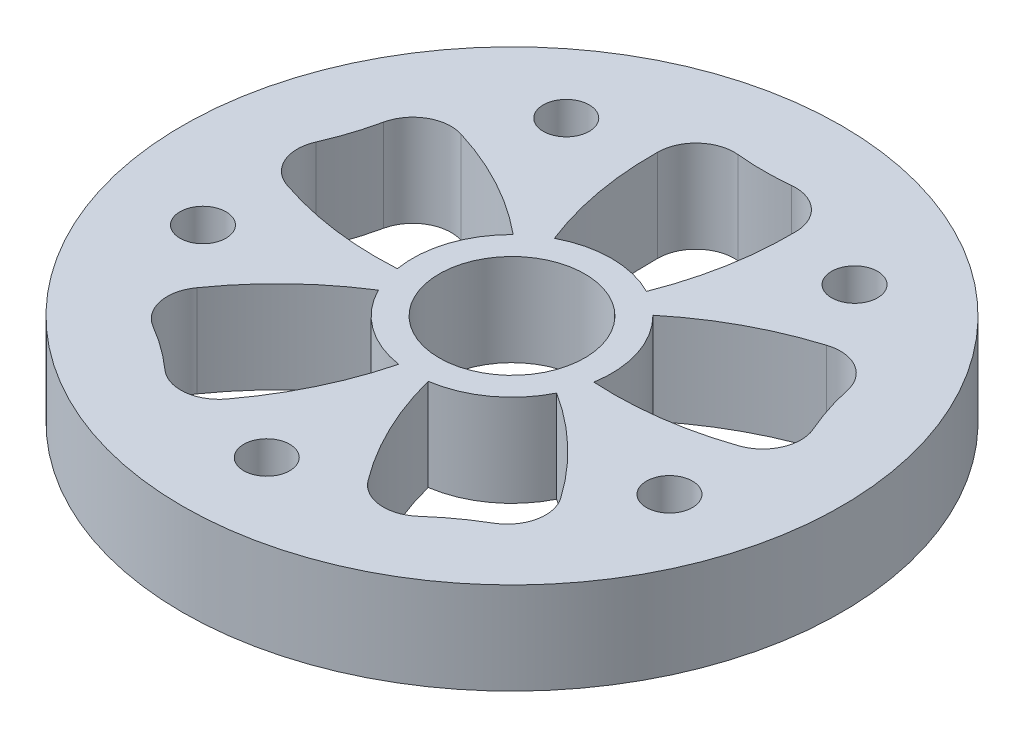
from build123d import *

# Parameters (mm, degrees)
SKETCH_1_R               = 43
SKETCH_1_R_2             = 9.5
SKETCH_1_R_3             = 3
EXTRUDE_1_DEPTH          = 6
CUT_EXTRUDE_1_DEPTH      = 62.10646447
CUT_EXTRUDE_1_DEPTH_BACK = 62.10646447


with BuildPart() as part:
    # Sketch 1 → Extrude 1 (new, symmetric)
    with BuildSketch(Plane(origin=(0, 0, 0), x_dir=(1, 0, 0), z_dir=(0, 1, 0))):
        with Locations(Location((0, 0, 0), (0, 0, 270))):
            Circle(SKETCH_1_R)
        with Locations(Location((0, 0, 0), (0, 0, 270))):
            Circle(SKETCH_1_R_2, mode=Mode.SUBTRACT)
        with Locations(Location((0, -32, 0), (0, 0, 270))):
            Circle(SKETCH_1_R_3, mode=Mode.SUBTRACT)
        with Locations(Location((-30.433808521, -9.88854382, 0), (0, 0, 270))):
            Circle(SKETCH_1_R_3, mode=Mode.SUBTRACT)
        with Locations(Location((-18.809128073, 25.88854382, 0), (0, 0, 270))):
            Circle(SKETCH_1_R_3, mode=Mode.SUBTRACT)
        with Locations(Location((18.809128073, 25.88854382, 0), (0, 0, 270))):
            Circle(SKETCH_1_R_3, mode=Mode.SUBTRACT)
        with Locations(Location((30.433808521, -9.88854382, 0), (0, 0, 270))):
            Circle(SKETCH_1_R_3, mode=Mode.SUBTRACT)
    extrude(amount=EXTRUDE_1_DEPTH, both=True)

    # Sketch 2 → Cut-Extrude 1 (cut, two sides: drawn at the far end of the back side and taken through both)
    with BuildSketch(Plane(origin=(0, 0, 0), x_dir=(1, 0, 0), z_dir=(0, 1, 0)).offset(-CUT_EXTRUDE_1_DEPTH_BACK)):
        with BuildLine():
            ThreePointArc((-9.114016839, 9.270096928), (-12.363734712, 4.017220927), (-12.822220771, -2.142581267))
            ThreePointArc((-12.822220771, -2.142581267), (-21.22630637, -1.839769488), (-29.410735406, 0.092967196))
            ThreePointArc((-29.410735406, 0.092967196), (-32.428736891, 2.804174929), (-32.442588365, 6.861118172))
            ThreePointArc((-32.442588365, 6.861118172), (-31.194175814, 10.13560213), (-30.279469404, 13.518513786))
            ThreePointArc((-30.279469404, 13.518513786), (-27.883651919, 16.792508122), (-23.848429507, 17.211984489))
            ThreePointArc((-23.848429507, 17.211984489), (-16.091053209, 13.964914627), (-9.114016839, 9.270096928))
        make_face()
        with BuildLine():
            ThreePointArc((-6, 11.532562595), (-8.309014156, 19.618896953), (-9, 28))
            ThreePointArc((-9, 28), (-7.354101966, 31.708099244), (-3.5, 32.974937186))
            ThreePointArc((-3.5, 32.974937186), (0, 32.799497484), (3.5, 32.974937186))
            ThreePointArc((3.5, 32.974937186), (7.354101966, 31.708099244), (9, 28))
            ThreePointArc((9, 28), (8.309014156, 19.618896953), (6, 11.532562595))
            ThreePointArc((6, 11.532562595), (0, 13), (-6, 11.532562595))
        make_face()
        with BuildLine():
            ThreePointArc((9.114016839, 9.270096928), (16.091053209, 13.964914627), (23.848429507, 17.211984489))
            ThreePointArc((23.848429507, 17.211984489), (27.883651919, 16.792508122), (30.279469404, 13.518513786))
            ThreePointArc((30.279469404, 13.518513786), (31.194175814, 10.13560213), (32.442588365, 6.861118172))
            ThreePointArc((32.442588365, 6.861118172), (32.428736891, 2.804174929), (29.410735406, 0.092967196))
            ThreePointArc((29.410735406, 0.092967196), (21.22630637, -1.839769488), (12.822220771, -2.142581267))
            ThreePointArc((12.822220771, -2.142581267), (12.363734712, 4.017220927), (9.114016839, 9.270096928))
        make_face()
        with BuildLine():
            ThreePointArc((11.632772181, -5.803327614), (18.253831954, -10.988105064), (23.739140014, -17.362408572))
            ThreePointArc((23.739140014, -17.362408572), (24.587146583, -21.329758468), (22.213741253, -24.620036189))
            ThreePointArc((22.213741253, -24.620036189), (19.279060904, -26.535350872), (16.550622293, -28.734532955))
            ThreePointArc((16.550622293, -28.734532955), (12.687959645, -29.975023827), (9.176834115, -27.942543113))
            ThreePointArc((9.176834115, -27.942543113), (4.809564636, -20.755937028), (1.924568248, -12.856750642))
            ThreePointArc((1.924568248, -12.856750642), (7.64120828, -10.517220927), (11.632772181, -5.803327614))
        make_face()
        with BuildLine():
            ThreePointArc((-1.924568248, -12.856750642), (-4.809564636, -20.755937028), (-9.176834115, -27.942543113))
            ThreePointArc((-9.176834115, -27.942543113), (-12.687959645, -29.975023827), (-16.550622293, -28.734532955))
            ThreePointArc((-16.550622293, -28.734532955), (-19.279060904, -26.535350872), (-22.213741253, -24.620036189))
            ThreePointArc((-22.213741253, -24.620036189), (-24.587146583, -21.329758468), (-23.739140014, -17.362408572))
            ThreePointArc((-23.739140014, -17.362408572), (-18.253831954, -10.988105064), (-11.632772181, -5.803327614))
            ThreePointArc((-11.632772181, -5.803327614), (-7.64120828, -10.517220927), (-1.924568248, -12.856750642))
        make_face()
    extrude(amount=CUT_EXTRUDE_1_DEPTH + CUT_EXTRUDE_1_DEPTH_BACK, mode=Mode.SUBTRACT)


solid = part.part
